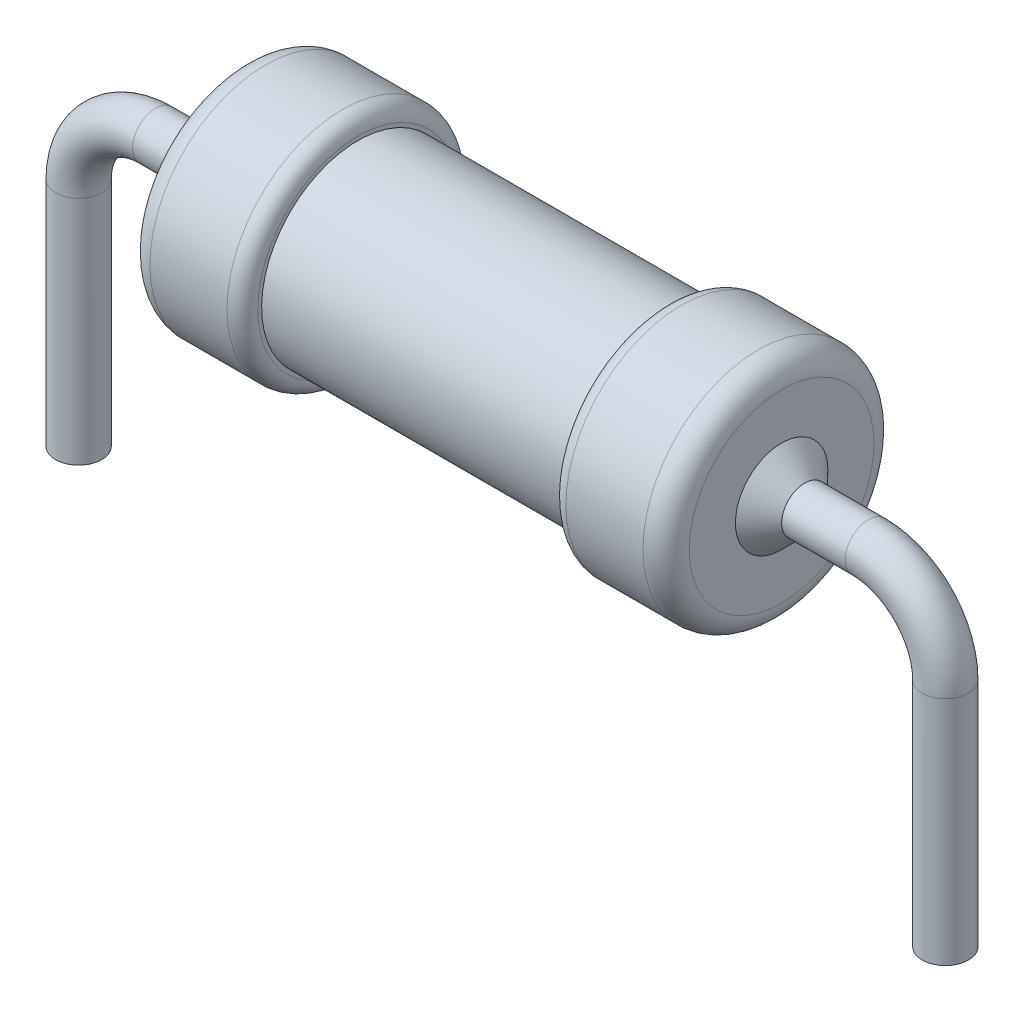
ISO-10303-21;
HEADER;
FILE_DESCRIPTION(('STEP AP214'),'2;1');
FILE_NAME('part.step','',(''),(''),'','','');
FILE_SCHEMA(('AUTOMOTIVE_DESIGN { 1 0 10303 214 1 1 1 1 }'));
ENDSEC;
DATA;
#1=APPLICATION_CONTEXT('core data for automotive mechanical design processes');
#2=APPLICATION_PROTOCOL_DEFINITION('international standard','automotive_design',2000,#1);
#3=PRODUCT_CONTEXT('',#1,'mechanical');
#4=PRODUCT('Part','Part','',(#3));
#5=PRODUCT_RELATED_PRODUCT_CATEGORY('part','',(#4));
#6=PRODUCT_DEFINITION_FORMATION('','',#4);
#7=PRODUCT_DEFINITION_CONTEXT('part definition',#1,'design');
#8=PRODUCT_DEFINITION('design','',#6,#7);
#9=PRODUCT_DEFINITION_SHAPE('','',#8);
#10=(LENGTH_UNIT() NAMED_UNIT(*) SI_UNIT(.MILLI.,.METRE.));
#11=(NAMED_UNIT(*) PLANE_ANGLE_UNIT() SI_UNIT($,.RADIAN.));
#12=(NAMED_UNIT(*) SI_UNIT($,.STERADIAN.) SOLID_ANGLE_UNIT());
#13=UNCERTAINTY_MEASURE_WITH_UNIT(LENGTH_MEASURE(1.E-05),#10,'distance_accuracy_value','');
#14=(GEOMETRIC_REPRESENTATION_CONTEXT(3) GLOBAL_UNCERTAINTY_ASSIGNED_CONTEXT((#13)) GLOBAL_UNIT_ASSIGNED_CONTEXT((#10,
#11,#12)) REPRESENTATION_CONTEXT('',''));
#15=CARTESIAN_POINT('',(0.,0.,0.));
#16=DIRECTION('',(0.,0.,1.));
#17=DIRECTION('',(1.,0.,0.));
#18=AXIS2_PLACEMENT_3D('',#15,#16,#17);
#19=CARTESIAN_POINT('',(3.8,1.50000000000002,0.));
#20=DIRECTION('',(-1.,0.,0.));
#21=DIRECTION('',(0.,-1.,0.));
#22=AXIS2_PLACEMENT_3D('',#19,#20,#21);
#23=CONICAL_SURFACE('',#22,0.299999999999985,0.785398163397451);
#24=CARTESIAN_POINT('',(3.5,1.50000000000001,0.));
#25=DIRECTION('',(-1.,0.,0.));
#26=DIRECTION('',(0.,-1.,0.));
#27=AXIS2_PLACEMENT_3D('',#24,#25,#26);
#28=CIRCLE('',#27,0.599999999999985);
#29=CARTESIAN_POINT('',(3.5,0.900000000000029,0.));
#30=VERTEX_POINT('',#29);
#31=EDGE_CURVE('E10',#30,#30,#28,.T.);
#32=ORIENTED_EDGE('',*,*,#31,.F.);
#33=EDGE_LOOP('',(#32));
#34=FACE_BOUND('',#33,.T.);
#35=CARTESIAN_POINT('',(3.8,1.50000000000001,0.));
#36=DIRECTION('',(1.,0.,0.));
#37=DIRECTION('',(0.,0.,-1.));
#38=AXIS2_PLACEMENT_3D('',#35,#36,#37);
#39=CIRCLE('',#38,0.299999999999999);
#40=CARTESIAN_POINT('',(3.8,1.50000000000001,-0.299999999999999));
#41=VERTEX_POINT('',#40);
#42=EDGE_CURVE('E114',#41,#41,#39,.T.);
#43=ORIENTED_EDGE('',*,*,#42,.F.);
#44=EDGE_LOOP('',(#43));
#45=FACE_BOUND('',#44,.T.);
#46=ADVANCED_FACE('F33',(#34,#45),#23,.T.);
#47=CARTESIAN_POINT('',(3.5,2.1,0.));
#48=DIRECTION('',(-1.,0.,0.));
#49=DIRECTION('',(0.,-1.,0.));
#50=AXIS2_PLACEMENT_3D('',#47,#48,#49);
#51=PLANE('',#50);
#52=CARTESIAN_POINT('',(3.5,1.50000000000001,0.));
#53=DIRECTION('',(-1.,0.,0.));
#54=DIRECTION('',(0.,-1.,0.));
#55=AXIS2_PLACEMENT_3D('',#52,#53,#54);
#56=CIRCLE('',#55,1.19999999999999);
#57=CARTESIAN_POINT('',(3.5,0.300000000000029,0.));
#58=VERTEX_POINT('',#57);
#59=EDGE_CURVE('E40',#58,#58,#56,.T.);
#60=ORIENTED_EDGE('',*,*,#59,.F.);
#61=EDGE_LOOP('',(#60));
#62=FACE_BOUND('',#61,.T.);
#63=ORIENTED_EDGE('',*,*,#31,.T.);
#64=EDGE_LOOP('',(#63));
#65=FACE_BOUND('',#64,.T.);
#66=ADVANCED_FACE('F132',(#62,#65),#51,.F.);
#67=CARTESIAN_POINT('',(3.2,1.50000000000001,0.));
#68=DIRECTION('',(-1.,0.,0.));
#69=DIRECTION('',(0.,-1.,0.));
#70=AXIS2_PLACEMENT_3D('',#67,#68,#69);
#71=TOROIDAL_SURFACE('',#70,1.19999999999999,0.3);
#72=CARTESIAN_POINT('',(3.2,1.50000000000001,0.));
#73=DIRECTION('',(-1.,0.,0.));
#74=DIRECTION('',(0.,-1.,0.));
#75=AXIS2_PLACEMENT_3D('',#72,#73,#74);
#76=CIRCLE('',#75,1.49999999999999);
#77=CARTESIAN_POINT('',(3.20000000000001,0.,0.));
#78=VERTEX_POINT('',#77);
#79=EDGE_CURVE('E47',#78,#78,#76,.T.);
#80=ORIENTED_EDGE('',*,*,#79,.F.);
#81=EDGE_LOOP('',(#80));
#82=FACE_BOUND('',#81,.T.);
#83=ORIENTED_EDGE('',*,*,#59,.T.);
#84=EDGE_LOOP('',(#83));
#85=FACE_BOUND('',#84,.T.);
#86=ADVANCED_FACE('F137',(#82,#85),#71,.T.);
#87=CARTESIAN_POINT('',(-3.8,1.5,0.));
#88=DIRECTION('',(-1.,0.,0.));
#89=DIRECTION('',(0.,-1.,0.));
#90=AXIS2_PLACEMENT_3D('',#87,#88,#89);
#91=CYLINDRICAL_SURFACE('',#90,1.49999999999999);
#92=CARTESIAN_POINT('',(2.2,1.50000000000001,0.));
#93=DIRECTION('',(-1.,0.,0.));
#94=DIRECTION('',(0.,-1.,0.));
#95=AXIS2_PLACEMENT_3D('',#92,#93,#94);
#96=CIRCLE('',#95,1.49999999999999);
#97=CARTESIAN_POINT('',(2.20000000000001,0.,0.));
#98=VERTEX_POINT('',#97);
#99=EDGE_CURVE('E54',#98,#98,#96,.T.);
#100=ORIENTED_EDGE('',*,*,#99,.F.);
#101=EDGE_LOOP('',(#100));
#102=FACE_BOUND('',#101,.T.);
#103=ORIENTED_EDGE('',*,*,#79,.T.);
#104=EDGE_LOOP('',(#103));
#105=FACE_BOUND('',#104,.T.);
#106=ADVANCED_FACE('F142',(#102,#105),#91,.T.);
#107=CARTESIAN_POINT('',(2.2,1.50000000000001,0.));
#108=DIRECTION('',(-1.,0.,0.));
#109=DIRECTION('',(0.,-1.,0.));
#110=AXIS2_PLACEMENT_3D('',#107,#108,#109);
#111=TOROIDAL_SURFACE('',#110,1.29999999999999,0.2);
#112=CARTESIAN_POINT('',(2.,1.50000000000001,0.));
#113=DIRECTION('',(-1.,0.,0.));
#114=DIRECTION('',(0.,-1.,0.));
#115=AXIS2_PLACEMENT_3D('',#112,#113,#114);
#116=CIRCLE('',#115,1.29999999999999);
#117=CARTESIAN_POINT('',(2.00000000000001,0.200000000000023,0.));
#118=VERTEX_POINT('',#117);
#119=EDGE_CURVE('E60',#118,#118,#116,.T.);
#120=ORIENTED_EDGE('',*,*,#119,.F.);
#121=EDGE_LOOP('',(#120));
#122=FACE_BOUND('',#121,.T.);
#123=ORIENTED_EDGE('',*,*,#99,.T.);
#124=EDGE_LOOP('',(#123));
#125=FACE_BOUND('',#124,.T.);
#126=ADVANCED_FACE('F148',(#122,#125),#111,.T.);
#127=CARTESIAN_POINT('',(2.,2.8,0.));
#128=DIRECTION('',(1.,0.,0.));
#129=DIRECTION('',(0.,1.,0.));
#130=AXIS2_PLACEMENT_3D('',#127,#128,#129);
#131=PLANE('',#130);
#132=CARTESIAN_POINT('',(2.,1.50000000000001,0.));
#133=DIRECTION('',(-1.,0.,0.));
#134=DIRECTION('',(0.,-1.,0.));
#135=AXIS2_PLACEMENT_3D('',#132,#133,#134);
#136=CIRCLE('',#135,1.24999999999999);
#137=CARTESIAN_POINT('',(2.00000000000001,0.250000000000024,0.));
#138=VERTEX_POINT('',#137);
#139=EDGE_CURVE('E64',#138,#138,#136,.T.);
#140=ORIENTED_EDGE('',*,*,#139,.F.);
#141=EDGE_LOOP('',(#140));
#142=FACE_BOUND('',#141,.T.);
#143=ORIENTED_EDGE('',*,*,#119,.T.);
#144=EDGE_LOOP('',(#143));
#145=FACE_BOUND('',#144,.T.);
#146=ADVANCED_FACE('F152',(#142,#145),#131,.F.);
#147=CARTESIAN_POINT('',(-3.8,1.5,0.));
#148=DIRECTION('',(-1.,0.,0.));
#149=DIRECTION('',(0.,-1.,0.));
#150=AXIS2_PLACEMENT_3D('',#147,#148,#149);
#151=CYLINDRICAL_SURFACE('',#150,1.24999999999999);
#152=CARTESIAN_POINT('',(-2.,1.5,0.));
#153=DIRECTION('',(-1.,0.,0.));
#154=DIRECTION('',(0.,-1.,0.));
#155=AXIS2_PLACEMENT_3D('',#152,#153,#154);
#156=CIRCLE('',#155,1.25);
#157=CARTESIAN_POINT('',(-1.99999999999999,0.250000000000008,0.));
#158=VERTEX_POINT('',#157);
#159=EDGE_CURVE('E67',#158,#158,#156,.T.);
#160=ORIENTED_EDGE('',*,*,#159,.F.);
#161=EDGE_LOOP('',(#160));
#162=FACE_BOUND('',#161,.T.);
#163=ORIENTED_EDGE('',*,*,#139,.T.);
#164=EDGE_LOOP('',(#163));
#165=FACE_BOUND('',#164,.T.);
#166=ADVANCED_FACE('F156',(#162,#165),#151,.T.);
#167=CARTESIAN_POINT('',(-2.,2.8,0.));
#168=DIRECTION('',(-1.,0.,0.));
#169=DIRECTION('',(0.,-1.,0.));
#170=AXIS2_PLACEMENT_3D('',#167,#168,#169);
#171=PLANE('',#170);
#172=CARTESIAN_POINT('',(-2.,1.5,0.));
#173=DIRECTION('',(-1.,0.,0.));
#174=DIRECTION('',(0.,-1.,0.));
#175=AXIS2_PLACEMENT_3D('',#172,#173,#174);
#176=CIRCLE('',#175,1.3);
#177=CARTESIAN_POINT('',(-1.99999999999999,0.200000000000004,0.));
#178=VERTEX_POINT('',#177);
#179=EDGE_CURVE('E71',#178,#178,#176,.T.);
#180=ORIENTED_EDGE('',*,*,#179,.F.);
#181=EDGE_LOOP('',(#180));
#182=FACE_BOUND('',#181,.T.);
#183=ORIENTED_EDGE('',*,*,#159,.T.);
#184=EDGE_LOOP('',(#183));
#185=FACE_BOUND('',#184,.T.);
#186=ADVANCED_FACE('F160',(#182,#185),#171,.F.);
#187=CARTESIAN_POINT('',(-2.2,1.5,0.));
#188=DIRECTION('',(-1.,0.,0.));
#189=DIRECTION('',(0.,-1.,0.));
#190=AXIS2_PLACEMENT_3D('',#187,#188,#189);
#191=TOROIDAL_SURFACE('',#190,1.3,0.200000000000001);
#192=CARTESIAN_POINT('',(-2.2,1.5,0.));
#193=DIRECTION('',(-1.,0.,0.));
#194=DIRECTION('',(0.,-1.,0.));
#195=AXIS2_PLACEMENT_3D('',#192,#193,#194);
#196=CIRCLE('',#195,1.5);
#197=CARTESIAN_POINT('',(-2.19999999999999,0.,0.));
#198=VERTEX_POINT('',#197);
#199=EDGE_CURVE('E75',#198,#198,#196,.T.);
#200=ORIENTED_EDGE('',*,*,#199,.F.);
#201=EDGE_LOOP('',(#200));
#202=FACE_BOUND('',#201,.T.);
#203=ORIENTED_EDGE('',*,*,#179,.T.);
#204=EDGE_LOOP('',(#203));
#205=FACE_BOUND('',#204,.T.);
#206=ADVANCED_FACE('F164',(#202,#205),#191,.T.);
#207=CARTESIAN_POINT('',(-3.8,1.5,0.));
#208=DIRECTION('',(-1.,0.,0.));
#209=DIRECTION('',(0.,-1.,0.));
#210=AXIS2_PLACEMENT_3D('',#207,#208,#209);
#211=CYLINDRICAL_SURFACE('',#210,1.5);
#212=CARTESIAN_POINT('',(-3.2,1.5,0.));
#213=DIRECTION('',(-1.,0.,0.));
#214=DIRECTION('',(0.,-1.,0.));
#215=AXIS2_PLACEMENT_3D('',#212,#213,#214);
#216=CIRCLE('',#215,1.5);
#217=CARTESIAN_POINT('',(-3.19999999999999,0.,0.));
#218=VERTEX_POINT('',#217);
#219=EDGE_CURVE('E79',#218,#218,#216,.T.);
#220=ORIENTED_EDGE('',*,*,#219,.F.);
#221=EDGE_LOOP('',(#220));
#222=FACE_BOUND('',#221,.T.);
#223=ORIENTED_EDGE('',*,*,#199,.T.);
#224=EDGE_LOOP('',(#223));
#225=FACE_BOUND('',#224,.T.);
#226=ADVANCED_FACE('F168',(#222,#225),#211,.T.);
#227=CARTESIAN_POINT('',(-3.2,1.5,0.));
#228=DIRECTION('',(-1.,0.,0.));
#229=DIRECTION('',(0.,-1.,0.));
#230=AXIS2_PLACEMENT_3D('',#227,#228,#229);
#231=TOROIDAL_SURFACE('',#230,1.2,0.3);
#232=CARTESIAN_POINT('',(-3.5,1.5,0.));
#233=DIRECTION('',(-1.,0.,0.));
#234=DIRECTION('',(0.,-1.,0.));
#235=AXIS2_PLACEMENT_3D('',#232,#233,#234);
#236=CIRCLE('',#235,1.2);
#237=CARTESIAN_POINT('',(-3.5,0.3,0.));
#238=VERTEX_POINT('',#237);
#239=EDGE_CURVE('E82',#238,#238,#236,.T.);
#240=ORIENTED_EDGE('',*,*,#239,.F.);
#241=EDGE_LOOP('',(#240));
#242=FACE_BOUND('',#241,.T.);
#243=ORIENTED_EDGE('',*,*,#219,.T.);
#244=EDGE_LOOP('',(#243));
#245=FACE_BOUND('',#244,.T.);
#246=ADVANCED_FACE('F172',(#242,#245),#231,.T.);
#247=CARTESIAN_POINT('',(-3.5,2.1,0.));
#248=DIRECTION('',(1.,0.,0.));
#249=DIRECTION('',(0.,1.,0.));
#250=AXIS2_PLACEMENT_3D('',#247,#248,#249);
#251=PLANE('',#250);
#252=CARTESIAN_POINT('',(-3.5,1.5,0.));
#253=DIRECTION('',(-1.,0.,0.));
#254=DIRECTION('',(0.,-1.,0.));
#255=AXIS2_PLACEMENT_3D('',#252,#253,#254);
#256=CIRCLE('',#255,0.6);
#257=CARTESIAN_POINT('',(-3.5,0.900000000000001,0.));
#258=VERTEX_POINT('',#257);
#259=EDGE_CURVE('E85',#258,#258,#256,.T.);
#260=ORIENTED_EDGE('',*,*,#259,.F.);
#261=EDGE_LOOP('',(#260));
#262=FACE_BOUND('',#261,.T.);
#263=ORIENTED_EDGE('',*,*,#239,.T.);
#264=EDGE_LOOP('',(#263));
#265=FACE_BOUND('',#264,.T.);
#266=ADVANCED_FACE('F176',(#262,#265),#251,.F.);
#267=CARTESIAN_POINT('',(-3.5,1.5,0.));
#268=DIRECTION('',(1.,0.,0.));
#269=DIRECTION('',(0.,1.,0.));
#270=AXIS2_PLACEMENT_3D('',#267,#268,#269);
#271=CONICAL_SURFACE('',#270,0.6,0.785398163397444);
#272=CARTESIAN_POINT('',(-3.8,1.5,0.));
#273=DIRECTION('',(-1.,0.,0.));
#274=DIRECTION('',(0.,-1.,0.));
#275=AXIS2_PLACEMENT_3D('',#272,#273,#274);
#276=CIRCLE('',#275,0.3);
#277=CARTESIAN_POINT('',(-3.8,1.2,0.));
#278=VERTEX_POINT('',#277);
#279=EDGE_CURVE('E89',#278,#278,#276,.T.);
#280=ORIENTED_EDGE('',*,*,#279,.F.);
#281=EDGE_LOOP('',(#280));
#282=FACE_BOUND('',#281,.T.);
#283=ORIENTED_EDGE('',*,*,#259,.T.);
#284=EDGE_LOOP('',(#283));
#285=FACE_BOUND('',#284,.T.);
#286=ADVANCED_FACE('F180',(#282,#285),#271,.T.);
#287=CARTESIAN_POINT('',(-5.62499999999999,0.500000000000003,0.));
#288=DIRECTION('',(0.,-1.,0.));
#289=DIRECTION('',(0.,0.,-1.));
#290=AXIS2_PLACEMENT_3D('',#287,#288,#289);
#291=CYLINDRICAL_SURFACE('',#290,0.3);
#292=CARTESIAN_POINT('',(-5.62499999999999,0.500000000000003,0.));
#293=DIRECTION('',(0.,-1.,0.));
#294=DIRECTION('',(0.,0.,1.));
#295=AXIS2_PLACEMENT_3D('',#292,#293,#294);
#296=CIRCLE('',#295,0.3);
#297=CARTESIAN_POINT('',(-5.92499999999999,0.500000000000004,0.));
#298=VERTEX_POINT('',#297);
#299=EDGE_CURVE('E97',#298,#298,#296,.T.);
#300=ORIENTED_EDGE('',*,*,#299,.T.);
#301=EDGE_LOOP('',(#300));
#302=FACE_BOUND('',#301,.T.);
#303=CARTESIAN_POINT('',(-5.62499999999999,-2.5,0.));
#304=DIRECTION('',(0.,-1.,0.));
#305=DIRECTION('',(0.,0.,1.));
#306=AXIS2_PLACEMENT_3D('',#303,#304,#305);
#307=CIRCLE('',#306,0.3);
#308=CARTESIAN_POINT('',(-5.62499999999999,-2.5,0.3));
#309=VERTEX_POINT('',#308);
#310=EDGE_CURVE('E93',#309,#309,#307,.T.);
#311=ORIENTED_EDGE('',*,*,#310,.F.);
#312=EDGE_LOOP('',(#311));
#313=FACE_BOUND('',#312,.T.);
#314=ADVANCED_FACE('F184',(#302,#313),#291,.T.);
#315=CARTESIAN_POINT('',(-4.625,0.5,0.));
#316=DIRECTION('',(0.,0.,1.));
#317=DIRECTION('',(1.,0.,0.));
#318=AXIS2_PLACEMENT_3D('',#315,#316,#317);
#319=TOROIDAL_SURFACE('',#318,0.999999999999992,0.3);
#320=CARTESIAN_POINT('',(-4.625,1.49999999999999,0.));
#321=DIRECTION('',(-1.,0.,0.));
#322=DIRECTION('',(0.,0.,1.));
#323=AXIS2_PLACEMENT_3D('',#320,#321,#322);
#324=CIRCLE('',#323,0.3);
#325=CARTESIAN_POINT('',(-4.625,1.79999999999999,0.));
#326=VERTEX_POINT('',#325);
#327=EDGE_CURVE('E101',#326,#326,#324,.T.);
#328=CARTESIAN_POINT('',(-4.625,0.5,0.));
#329=DIRECTION('',(0.,0.,1.));
#330=DIRECTION('',(1.,0.,0.));
#331=AXIS2_PLACEMENT_3D('',#328,#329,#330);
#332=CIRCLE('',#331,1.29999999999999);
#333=EDGE_CURVE('',#326,#298,#332,.T.);
#334=ORIENTED_EDGE('',*,*,#327,.T.);
#335=ORIENTED_EDGE('',*,*,#299,.F.);
#336=ORIENTED_EDGE('',*,*,#333,.T.);
#337=ORIENTED_EDGE('',*,*,#333,.F.);
#338=EDGE_LOOP('',(#334,#336,#335,#337));
#339=FACE_BOUND('',#338,.T.);
#340=ADVANCED_FACE('F188',(#339),#319,.T.);
#341=CARTESIAN_POINT('',(-4.625,1.49999999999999,0.));
#342=DIRECTION('',(1.,0.,0.));
#343=DIRECTION('',(0.,0.,-1.));
#344=AXIS2_PLACEMENT_3D('',#341,#342,#343);
#345=CYLINDRICAL_SURFACE('',#344,0.3);
#346=ORIENTED_EDGE('',*,*,#327,.F.);
#347=EDGE_LOOP('',(#346));
#348=FACE_BOUND('',#347,.T.);
#349=ORIENTED_EDGE('',*,*,#279,.T.);
#350=EDGE_LOOP('',(#349));
#351=FACE_BOUND('',#350,.T.);
#352=ADVANCED_FACE('F192',(#348,#351),#345,.T.);
#353=CARTESIAN_POINT('',(-5.62499999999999,-2.5,0.));
#354=DIRECTION('',(0.,-1.,0.));
#355=DIRECTION('',(0.,0.,1.));
#356=AXIS2_PLACEMENT_3D('',#353,#354,#355);
#357=PLANE('',#356);
#358=ORIENTED_EDGE('',*,*,#310,.T.);
#359=EDGE_LOOP('',(#358));
#360=FACE_BOUND('',#359,.T.);
#361=ADVANCED_FACE('F196',(#360),#357,.T.);
#362=CARTESIAN_POINT('',(5.62500000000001,0.499999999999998,0.));
#363=DIRECTION('',(0.,-1.,0.));
#364=DIRECTION('',(1.,0.,0.));
#365=AXIS2_PLACEMENT_3D('',#362,#363,#364);
#366=CYLINDRICAL_SURFACE('',#365,0.299999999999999);
#367=CARTESIAN_POINT('',(5.62500000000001,0.499999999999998,0.));
#368=DIRECTION('',(0.,-1.,0.));
#369=DIRECTION('',(0.,0.,-1.));
#370=AXIS2_PLACEMENT_3D('',#367,#368,#369);
#371=CIRCLE('',#370,0.299999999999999);
#372=CARTESIAN_POINT('',(5.92500000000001,0.499999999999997,0.));
#373=VERTEX_POINT('',#372);
#374=EDGE_CURVE('E109',#373,#373,#371,.T.);
#375=ORIENTED_EDGE('',*,*,#374,.T.);
#376=EDGE_LOOP('',(#375));
#377=FACE_BOUND('',#376,.T.);
#378=CARTESIAN_POINT('',(5.62500000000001,-2.5,0.));
#379=DIRECTION('',(0.,-1.,0.));
#380=DIRECTION('',(0.,0.,-1.));
#381=AXIS2_PLACEMENT_3D('',#378,#379,#380);
#382=CIRCLE('',#381,0.299999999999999);
#383=CARTESIAN_POINT('',(5.62500000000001,-2.5,-0.299999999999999));
#384=VERTEX_POINT('',#383);
#385=EDGE_CURVE('E105',#384,#384,#382,.T.);
#386=ORIENTED_EDGE('',*,*,#385,.F.);
#387=EDGE_LOOP('',(#386));
#388=FACE_BOUND('',#387,.T.);
#389=ADVANCED_FACE('F200',(#377,#388),#366,.T.);
#390=CARTESIAN_POINT('',(4.625,0.500000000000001,0.));
#391=DIRECTION('',(0.,0.,-1.));
#392=DIRECTION('',(-1.,0.,0.));
#393=AXIS2_PLACEMENT_3D('',#390,#391,#392);
#394=TOROIDAL_SURFACE('',#393,1.00000000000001,0.299999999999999);
#395=CARTESIAN_POINT('',(4.625,1.50000000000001,0.));
#396=DIRECTION('',(1.,0.,0.));
#397=DIRECTION('',(0.,0.,-1.));
#398=AXIS2_PLACEMENT_3D('',#395,#396,#397);
#399=CIRCLE('',#398,0.299999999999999);
#400=CARTESIAN_POINT('',(4.625,1.80000000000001,0.));
#401=VERTEX_POINT('',#400);
#402=EDGE_CURVE('E113',#401,#401,#399,.T.);
#403=CARTESIAN_POINT('',(4.625,0.500000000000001,0.));
#404=DIRECTION('',(0.,0.,-1.));
#405=DIRECTION('',(-1.,0.,0.));
#406=AXIS2_PLACEMENT_3D('',#403,#404,#405);
#407=CIRCLE('',#406,1.30000000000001);
#408=EDGE_CURVE('',#401,#373,#407,.T.);
#409=ORIENTED_EDGE('',*,*,#402,.T.);
#410=ORIENTED_EDGE('',*,*,#374,.F.);
#411=ORIENTED_EDGE('',*,*,#408,.T.);
#412=ORIENTED_EDGE('',*,*,#408,.F.);
#413=EDGE_LOOP('',(#409,#411,#410,#412));
#414=FACE_BOUND('',#413,.T.);
#415=ADVANCED_FACE('F121',(#414),#394,.T.);
#416=CARTESIAN_POINT('',(4.625,1.50000000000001,0.));
#417=DIRECTION('',(-1.,0.,0.));
#418=DIRECTION('',(0.,-1.,0.));
#419=AXIS2_PLACEMENT_3D('',#416,#417,#418);
#420=CYLINDRICAL_SURFACE('',#419,0.299999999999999);
#421=ORIENTED_EDGE('',*,*,#402,.F.);
#422=EDGE_LOOP('',(#421));
#423=FACE_BOUND('',#422,.T.);
#424=ORIENTED_EDGE('',*,*,#42,.T.);
#425=EDGE_LOOP('',(#424));
#426=FACE_BOUND('',#425,.T.);
#427=ADVANCED_FACE('F124',(#423,#426),#420,.T.);
#428=CARTESIAN_POINT('',(5.62500000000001,-2.5,0.));
#429=DIRECTION('',(0.,-1.,0.));
#430=DIRECTION('',(0.,0.,-1.));
#431=AXIS2_PLACEMENT_3D('',#428,#429,#430);
#432=PLANE('',#431);
#433=ORIENTED_EDGE('',*,*,#385,.T.);
#434=EDGE_LOOP('',(#433));
#435=FACE_BOUND('',#434,.T.);
#436=ADVANCED_FACE('F127',(#435),#432,.T.);
#437=CLOSED_SHELL('',(#46,#66,#86,#106,#126,#146,#166,#186,#206,#226,#246,#266,#286,#314,#340,
#352,#361,#389,#415,#427,#436));
#438=MANIFOLD_SOLID_BREP('B2',#437);
#439=ADVANCED_BREP_SHAPE_REPRESENTATION('',(#18,#438),#14);
#440=SHAPE_DEFINITION_REPRESENTATION(#9,#439);
ENDSEC;
END-ISO-10303-21;
